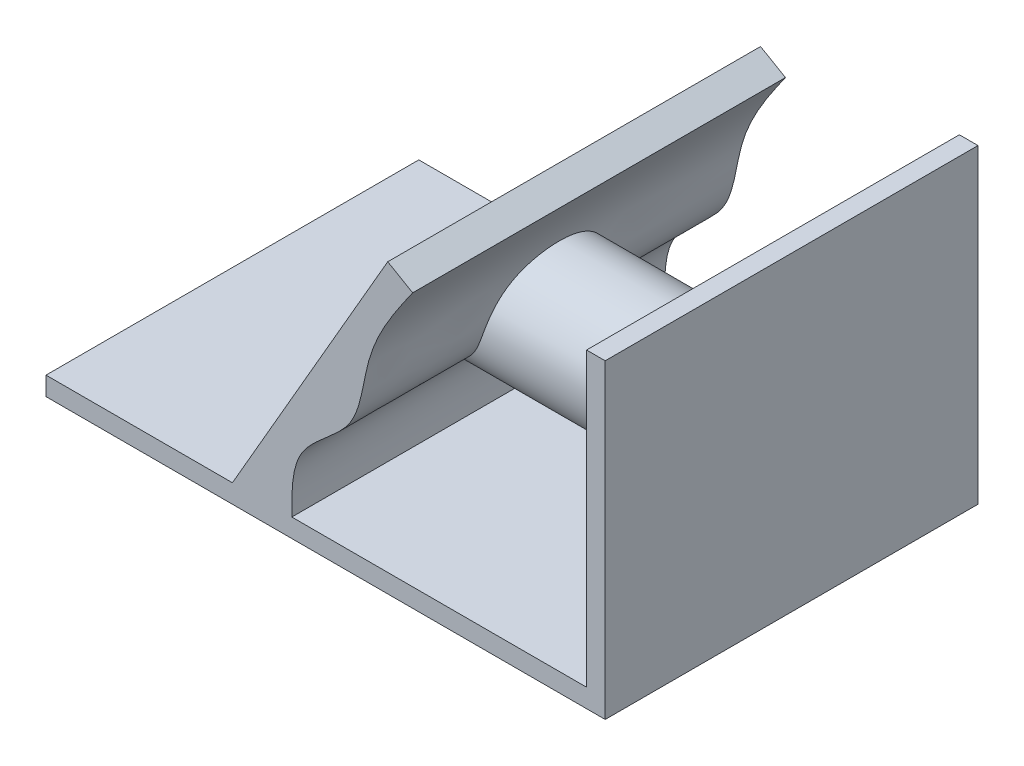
from build123d import *

# Parameters (mm, degrees)
EXTRUDE_THIN1_DEPTH = 30
EXTRUDE2_DEPTH      = 30
EXTRUDE3_REACH      = 106.733
SKETCH8_R           = 10


with BuildPart() as part:
    # Sketch1 → Extrude-Thin1 (new, symmetric)
    with BuildSketch(Plane.XY):
        Polygon((0, 50), (0, 0), (-90, 0), (-90, 3), (-3, 3), (-3, 50), align=None)
    extrude(amount=EXTRUDE_THIN1_DEPTH, both=True)

    # Sketch7 → Extrude2 (add, symmetric)
    with BuildSketch(Plane.XY):
        with BuildLine():
            Line((-60, 3), (-35, 46.301270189))
            Line((-35, 46.301270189), (-30.985323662, 43.983395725))
            add(Edge.make_bspline(
                [(-30.985323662, 43.983395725), (-33.835596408, 39.915411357), (-38.768329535, 32.875284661), (-39.38407028, 19.591205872), (-50.518512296, 13.941091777), (-50.460753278, 6.447080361), (-50.434185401, 3)],
                knots=[0, 0, 0, 0, 0.31667821, 0.54804899, 0.79211248, 1, 1, 1, 1], degree=3))
            Line((-50.434185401, 3), (-60, 3))
        make_face()
    extrude(amount=EXTRUDE2_DEPTH, both=True)

    # Sketch8 → Extrude3 (add, up to next)
    with BuildSketch(Plane.ZY.offset(3), mode=Mode.PRIVATE) as extrude3_sk1:
        with Locations(Location((0, 23, 0), (0, 0, 180))):
            Circle(SKETCH8_R)
    extrude3_tool1 = extrude(extrude3_sk1.sketch, amount=EXTRUDE3_REACH, mode=Mode.PRIVATE) - part.part
    add(extrude3_tool1.solids().sort_by_distance((-3, 23, 0))[0])


solid = part.part
